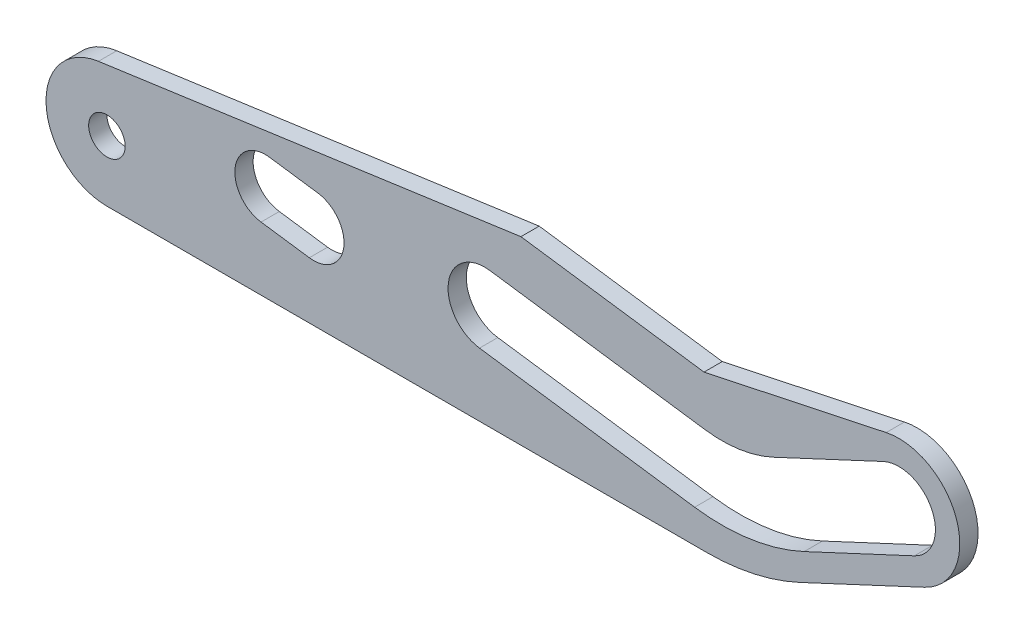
from build123d import *

# Parameters (mm, degrees)
BASE_EXTRUSION_DEPTH      = 0.75
BASE_EXTRUSION_DEPTH_BACK = 0.75
ESQUISSE1_R               = 1.5


with BuildPart() as part:
    # Esquisse1 → Base-Extrusion (new, two sides: drawn at the far end of the back side and taken through both)
    with BuildSketch(Plane.XY.offset(-BASE_EXTRUSION_DEPTH_BACK)):
        with BuildLine():
            Line((-0.695865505, 4.951340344), (33.980829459, 9.824831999))
            Line((33.980829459, 9.824831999), (49.00913982, 7.712740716))
            Line((49.00913982, 7.712740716), (63.960441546, 10.890738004))
            ThreePointArc((63.960441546, 10.890738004), (69.741618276, 7.586523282), (67.113091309, 1.468461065))
            Line((67.113091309, 1.468461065), (56.858056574, -3.313540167))
            ThreePointArc((56.858056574, -3.313540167), (53.146840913, -4.573328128), (49.250927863, -5))
            Line((49.250927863, -5), (0, -5))
            ThreePointArc((0, -5), (-4.987820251, -0.348782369), (-0.695865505, 4.951340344))
        make_face()
        Circle(ESQUISSE1_R, mode=Mode.SUBTRACT)
        with BuildLine():
            Line((63.732145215, 8.718923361), (54.692776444, 4.503796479))
            ThreePointArc((54.692776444, 4.503796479), (51.944687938, 3.676715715), (49.074862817, 3.664193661))
            Line((49.074862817, 3.664193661), (31.417519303, 6.145771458))
            ThreePointArc((31.417519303, 6.145771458), (28.029195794, 3.592486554), (30.582480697, 0.204163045))
            Line((30.582480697, 0.204163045), (48.239824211, -2.277414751))
            ThreePointArc((48.239824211, -2.277414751), (52.831544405, -2.257379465), (57.228486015, -0.934050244))
            Line((57.228486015, -0.934050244), (66.267854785, 3.281076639))
            ThreePointArc((66.267854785, 3.281076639), (67.718923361, 7.267854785), (63.732145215, 8.718923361))
        make_face(mode=Mode.SUBTRACT)
        with BuildLine():
            Line((17.309005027, 4.594197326), (13.347932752, 5.15088973))
            ThreePointArc((13.347932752, 5.15088973), (10.524329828, 3.023152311), (12.652067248, 0.199549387))
            Line((12.652067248, 0.199549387), (16.613139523, -0.357143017))
            ThreePointArc((16.613139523, -0.357143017), (19.436742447, 1.770594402), (17.309005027, 4.594197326))
        make_face(mode=Mode.SUBTRACT)
    extrude(amount=BASE_EXTRUSION_DEPTH + BASE_EXTRUSION_DEPTH_BACK)


solid = part.part
